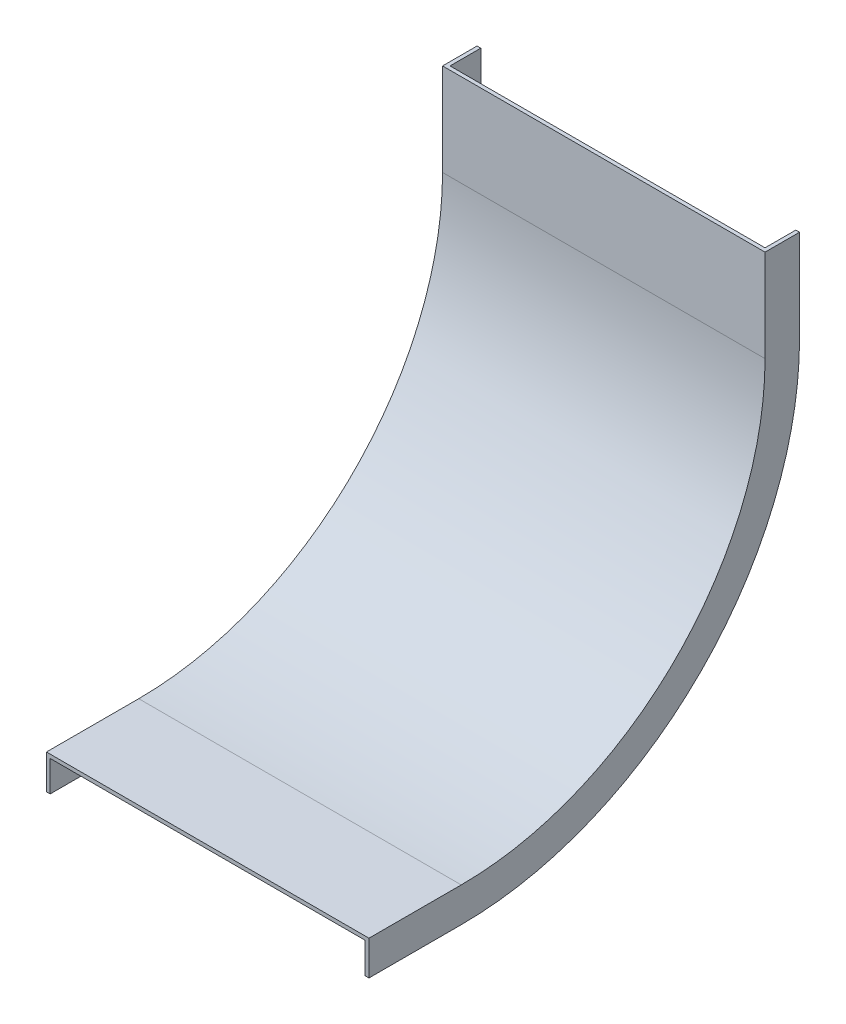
from build123d import *


with BuildPart() as part:
    # Sweep1: sweep along a path in Sketch1
    with BuildLine(Plane(origin=(0, 0, 0), x_dir=(0, 0, -1), z_dir=(1, 0, 0))) as sweep1_path:
        Line((0, 0), (30, 0))
        ThreePointArc((30, 0), (100.710678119, 29.289321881), (130, 100))
        Line((130, 100), (130, 130))
    # Sketch2 → Sweep1 (sweep)
    with BuildSketch(Plane.XY):
        Polygon((0, -10), (0, 0), (-102.428, 0), (-102.428, -10), (-103.642, -10), (-103.642, 1.214), (1.214, 1.214), (1.214, -10), align=None)
    sweep(path=sweep1_path.line)


solid = part.part
